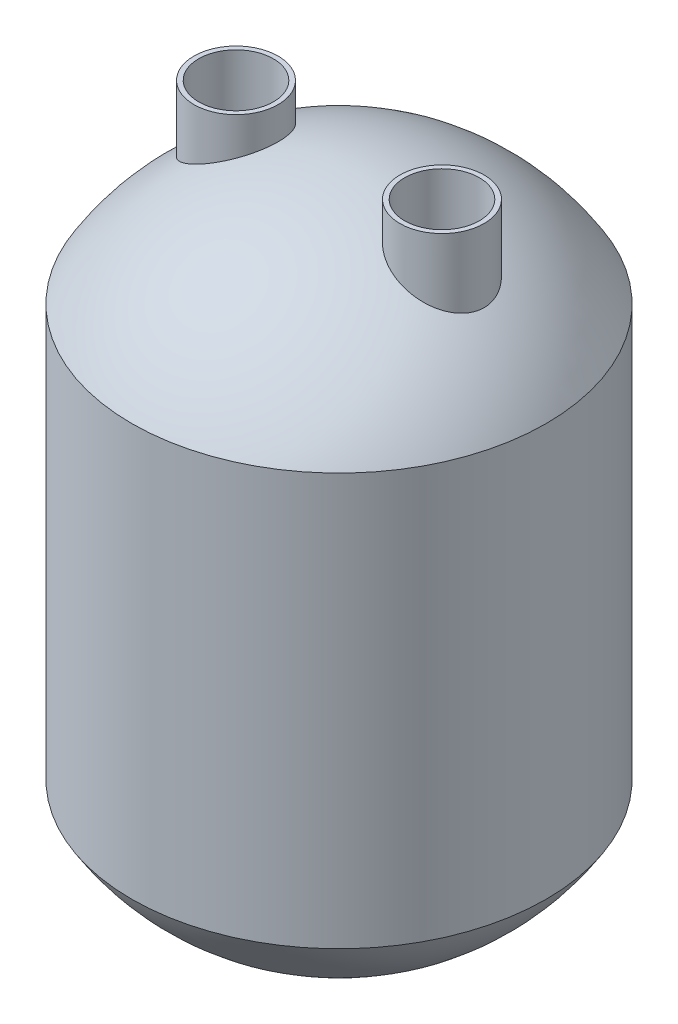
ISO-10303-21;
HEADER;
FILE_DESCRIPTION(('STEP AP214'),'2;1');
FILE_NAME('part.step','',(''),(''),'','','');
FILE_SCHEMA(('AUTOMOTIVE_DESIGN { 1 0 10303 214 1 1 1 1 }'));
ENDSEC;
DATA;
#1=APPLICATION_CONTEXT('core data for automotive mechanical design processes');
#2=APPLICATION_PROTOCOL_DEFINITION('international standard','automotive_design',2000,#1);
#3=PRODUCT_CONTEXT('',#1,'mechanical');
#4=PRODUCT('Part','Part','',(#3));
#5=PRODUCT_RELATED_PRODUCT_CATEGORY('part','',(#4));
#6=PRODUCT_DEFINITION_FORMATION('','',#4);
#7=PRODUCT_DEFINITION_CONTEXT('part definition',#1,'design');
#8=PRODUCT_DEFINITION('design','',#6,#7);
#9=PRODUCT_DEFINITION_SHAPE('','',#8);
#10=(LENGTH_UNIT() NAMED_UNIT(*) SI_UNIT(.MILLI.,.METRE.));
#11=(NAMED_UNIT(*) PLANE_ANGLE_UNIT() SI_UNIT($,.RADIAN.));
#12=(NAMED_UNIT(*) SI_UNIT($,.STERADIAN.) SOLID_ANGLE_UNIT());
#13=UNCERTAINTY_MEASURE_WITH_UNIT(LENGTH_MEASURE(1.E-05),#10,'distance_accuracy_value','');
#14=(GEOMETRIC_REPRESENTATION_CONTEXT(3) GLOBAL_UNCERTAINTY_ASSIGNED_CONTEXT((#13)) GLOBAL_UNIT_ASSIGNED_CONTEXT((#10,
#11,#12)) REPRESENTATION_CONTEXT('',''));
#15=CARTESIAN_POINT('',(0.,0.,0.));
#16=DIRECTION('',(0.,0.,1.));
#17=DIRECTION('',(1.,0.,0.));
#18=AXIS2_PLACEMENT_3D('',#15,#16,#17);
#19=CARTESIAN_POINT('',(0.,79.6999306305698,0.));
#20=DIRECTION('',(0.,1.,0.));
#21=DIRECTION('',(1.,0.,0.));
#22=AXIS2_PLACEMENT_3D('',#19,#20,#21);
#23=SPHERICAL_SURFACE('',#22,78.);
#24=CARTESIAN_POINT('',(32.7212474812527,149.083089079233,-14.1172691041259));
#25=CARTESIAN_POINT('',(33.1679584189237,148.857747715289,-14.1893744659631));
#26=CARTESIAN_POINT('',(33.6169962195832,148.630132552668,-14.2400963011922));
#27=CARTESIAN_POINT('',(34.5165230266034,148.171865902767,-14.2989339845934));
#28=CARTESIAN_POINT('',(34.9670125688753,147.941213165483,-14.3070317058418));
#29=CARTESIAN_POINT('',(35.8667764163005,147.478167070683,-14.2808118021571));
#30=CARTESIAN_POINT('',(36.3160475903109,147.245771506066,-14.2464257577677));
#31=CARTESIAN_POINT('',(37.2096489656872,146.78113934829,-14.1354252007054));
#32=CARTESIAN_POINT('',(37.6539771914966,146.548902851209,-14.0587943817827));
#33=CARTESIAN_POINT('',(38.5342018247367,146.086445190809,-13.8637133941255));
#34=CARTESIAN_POINT('',(38.9701015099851,145.856223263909,-13.7452798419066));
#35=CARTESIAN_POINT('',(39.8304714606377,145.399467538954,-13.4670319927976));
#36=CARTESIAN_POINT('',(40.2549421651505,145.172933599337,-13.3072192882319));
#37=CARTESIAN_POINT('',(41.0892307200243,144.725417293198,-12.9467278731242));
#38=CARTESIAN_POINT('',(41.4990485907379,144.504434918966,-12.7460492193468));
#39=CARTESIAN_POINT('',(42.3004416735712,144.070158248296,-12.3045808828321));
#40=CARTESIAN_POINT('',(42.6920269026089,143.856859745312,-12.0638135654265));
#41=CARTESIAN_POINT('',(43.4451333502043,143.444673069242,-11.5487289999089));
#42=CARTESIAN_POINT('',(43.8071310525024,143.245569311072,-11.2752824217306));
#43=CARTESIAN_POINT('',(44.506841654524,142.859003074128,-10.6919295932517));
#44=CARTESIAN_POINT('',(44.8445668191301,142.671534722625,-10.3820419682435));
#45=CARTESIAN_POINT('',(45.4922393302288,142.310519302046,-9.72701856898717));
#46=CARTESIAN_POINT('',(45.8021910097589,142.136970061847,-9.38188831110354));
#47=CARTESIAN_POINT('',(46.2432100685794,141.88909483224,-8.83937705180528));
#48=CARTESIAN_POINT('',(46.3862287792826,141.808546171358,-8.65440835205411));
#49=CARTESIAN_POINT('',(46.6639128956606,141.651865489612,-8.27636152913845));
#50=CARTESIAN_POINT('',(46.7985747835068,141.575735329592,-8.08328004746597));
#51=CARTESIAN_POINT('',(47.1612213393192,141.370359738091,-7.53473751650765));
#52=CARTESIAN_POINT('',(47.3794802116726,141.246333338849,-7.17079271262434));
#53=CARTESIAN_POINT('',(47.7846192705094,141.015507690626,-6.42067877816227));
#54=CARTESIAN_POINT('',(47.9715060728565,140.908704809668,-6.03451435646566));
#55=CARTESIAN_POINT('',(48.2261603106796,140.762858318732,-5.44105070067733));
#56=CARTESIAN_POINT('',(48.3067476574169,140.716646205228,-5.24091524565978));
#57=CARTESIAN_POINT('',(48.4590807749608,140.629203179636,-4.83630799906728));
#58=CARTESIAN_POINT('',(48.5308288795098,140.587970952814,-4.63183736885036));
#59=CARTESIAN_POINT('',(48.7323698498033,140.472046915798,-4.01251868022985));
#60=CARTESIAN_POINT('',(48.8485177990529,140.405094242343,-3.59162807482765));
#61=CARTESIAN_POINT('',(49.0288079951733,140.301050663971,-2.79729323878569));
#62=CARTESIAN_POINT('',(49.0979186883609,140.26111183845,-2.42532921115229));
#63=CARTESIAN_POINT('',(49.2065294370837,140.19831022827,-1.6756726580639));
#64=CARTESIAN_POINT('',(49.246032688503,140.175445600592,-1.29798075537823));
#65=CARTESIAN_POINT('',(49.2948362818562,140.147194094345,-0.540170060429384));
#66=CARTESIAN_POINT('',(49.3041496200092,140.141799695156,-0.160052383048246));
#67=CARTESIAN_POINT('',(49.2924731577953,140.148560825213,0.599558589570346));
#68=CARTESIAN_POINT('',(49.2714843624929,140.160715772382,0.979051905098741));
#69=CARTESIAN_POINT('',(49.2023408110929,140.200728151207,1.70463114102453));
#70=CARTESIAN_POINT('',(49.1564407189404,140.22728219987,2.05100717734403));
#71=CARTESIAN_POINT('',(49.039738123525,140.294727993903,2.73809489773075));
#72=CARTESIAN_POINT('',(48.9689373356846,140.335618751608,3.07880697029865));
#73=CARTESIAN_POINT('',(48.803268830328,140.431170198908,3.75233968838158));
#74=CARTESIAN_POINT('',(48.7084012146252,140.485830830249,4.08516036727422));
#75=CARTESIAN_POINT('',(48.4956561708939,140.608204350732,4.740895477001));
#76=CARTESIAN_POINT('',(48.3777778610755,140.675917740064,5.0638095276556));
#77=CARTESIAN_POINT('',(48.1170897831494,140.825370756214,5.70568714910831));
#78=CARTESIAN_POINT('',(47.9737407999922,140.90741290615,6.02436097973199));
#79=CARTESIAN_POINT('',(47.6656313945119,141.083344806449,6.64775776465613));
#80=CARTESIAN_POINT('',(47.5008708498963,141.177234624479,6.95248063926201));
#81=CARTESIAN_POINT('',(47.1514199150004,141.375861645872,7.54664209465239));
#82=CARTESIAN_POINT('',(46.9667255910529,141.48060099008,7.83607764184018));
#83=CARTESIAN_POINT('',(46.578962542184,141.699887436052,8.39847102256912));
#84=CARTESIAN_POINT('',(46.3758918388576,141.814435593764,8.67142707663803));
#85=CARTESIAN_POINT('',(45.9315498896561,142.064332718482,9.22659543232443));
#86=CARTESIAN_POINT('',(45.6884918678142,142.200614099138,9.50695892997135));
#87=CARTESIAN_POINT('',(45.183970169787,142.482507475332,10.0455429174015));
#88=CARTESIAN_POINT('',(44.9225054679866,142.628119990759,10.3037621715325));
#89=CARTESIAN_POINT('',(44.3830478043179,142.9274487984,10.7973186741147));
#90=CARTESIAN_POINT('',(44.1050516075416,143.081166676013,11.0326514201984));
#91=CARTESIAN_POINT('',(43.5343309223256,143.395547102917,11.4798380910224));
#92=CARTESIAN_POINT('',(43.2416012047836,143.556212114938,11.6916835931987));
#93=CARTESIAN_POINT('',(42.6051756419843,143.904149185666,12.1167551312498));
#94=CARTESIAN_POINT('',(42.2597332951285,144.092206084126,12.3267289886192));
#95=CARTESIAN_POINT('',(41.5548649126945,144.474199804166,12.7155727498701));
#96=CARTESIAN_POINT('',(41.1954375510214,144.668137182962,12.894439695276));
#97=CARTESIAN_POINT('',(40.4647273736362,145.060603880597,13.2207006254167));
#98=CARTESIAN_POINT('',(40.09343855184,145.259135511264,13.3680783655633));
#99=CARTESIAN_POINT('',(39.3415149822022,145.65934232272,13.6308410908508));
#100=CARTESIAN_POINT('',(38.9608826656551,145.861016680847,13.7462343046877));
#101=CARTESIAN_POINT('',(38.1533679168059,146.286896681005,13.9548316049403));
#102=CARTESIAN_POINT('',(37.7257070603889,146.511314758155,14.0446026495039));
#103=CARTESIAN_POINT('',(36.8644073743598,146.961004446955,14.1846525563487));
#104=CARTESIAN_POINT('',(36.4307683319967,147.186276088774,14.2349300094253));
#105=CARTESIAN_POINT('',(35.5602626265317,147.636240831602,14.2956815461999));
#106=CARTESIAN_POINT('',(35.1233951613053,147.860933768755,14.30614538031));
#107=CARTESIAN_POINT('',(34.2494160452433,148.308245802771,14.2869767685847));
#108=CARTESIAN_POINT('',(33.8123043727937,148.530864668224,14.2573399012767));
#109=CARTESIAN_POINT('',(32.9258150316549,148.980195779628,14.1560436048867));
#110=CARTESIAN_POINT('',(32.4765348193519,149.206784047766,14.0829688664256));
#111=CARTESIAN_POINT('',(31.5846084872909,149.654469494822,13.89362816));
#112=CARTESIAN_POINT('',(31.1419599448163,149.875568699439,13.7773783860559));
#113=CARTESIAN_POINT('',(30.2665760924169,150.310815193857,13.501674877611));
#114=CARTESIAN_POINT('',(29.8338426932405,150.524961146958,13.3422128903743));
#115=CARTESIAN_POINT('',(29.195340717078,150.839562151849,13.0709388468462));
#116=CARTESIAN_POINT('',(28.9842717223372,150.943326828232,12.9751665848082));
#117=CARTESIAN_POINT('',(28.5660275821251,151.148503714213,12.7729392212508));
#118=CARTESIAN_POINT('',(28.358853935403,151.249915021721,12.6664801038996));
#119=CARTESIAN_POINT('',(27.7619231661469,151.541506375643,12.340968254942));
#120=CARTESIAN_POINT('',(27.3780539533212,151.728251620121,12.1078138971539));
#121=CARTESIAN_POINT('',(26.6305231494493,152.090580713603,11.6036684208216));
#122=CARTESIAN_POINT('',(26.2668594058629,152.266165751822,11.3326813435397));
#123=CARTESIAN_POINT('',(25.5636436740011,152.604550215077,10.7541785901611));
#124=CARTESIAN_POINT('',(25.2240814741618,152.767355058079,10.4466785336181));
#125=CARTESIAN_POINT('',(24.572901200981,153.078613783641,9.79679179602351));
#126=CARTESIAN_POINT('',(24.2612799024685,153.22706932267,9.45440915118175));
#127=CARTESIAN_POINT('',(23.6985467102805,153.494428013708,8.77174672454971));
#128=CARTESIAN_POINT('',(23.4444975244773,153.614800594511,8.43445803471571));
#129=CARTESIAN_POINT('',(22.9653331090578,153.841346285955,7.73538764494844));
#130=CARTESIAN_POINT('',(22.7402132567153,153.947521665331,7.37360987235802));
#131=CARTESIAN_POINT('',(22.4264160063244,154.095248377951,6.81473944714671));
#132=CARTESIAN_POINT('',(22.3258036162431,154.142564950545,6.62576261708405));
#133=CARTESIAN_POINT('',(22.1328425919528,154.233232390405,6.24277445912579));
#134=CARTESIAN_POINT('',(22.0404918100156,154.276584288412,6.04876445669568));
#135=CARTESIAN_POINT('',(21.7762713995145,154.400518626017,5.45967802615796));
#136=CARTESIAN_POINT('',(21.6171807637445,154.475004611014,5.05745108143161));
#137=CARTESIAN_POINT('',(21.3498722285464,154.600013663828,4.27966348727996));
#138=CARTESIAN_POINT('',(21.2381183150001,154.652207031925,3.90557419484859));
#139=CARTESIAN_POINT('',(21.0452977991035,154.742193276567,3.14786310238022));
#140=CARTESIAN_POINT('',(20.9642288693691,154.779987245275,2.76424202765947));
#141=CARTESIAN_POINT('',(20.8338010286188,154.840764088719,1.99063782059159));
#142=CARTESIAN_POINT('',(20.7844305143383,154.86375238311,1.60065706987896));
#143=CARTESIAN_POINT('',(20.7179698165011,154.894693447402,0.817361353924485));
#144=CARTESIAN_POINT('',(20.7008785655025,154.902646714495,0.424046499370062));
#145=CARTESIAN_POINT('',(20.6992404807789,154.903409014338,-0.337928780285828));
#146=CARTESIAN_POINT('',(20.7127166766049,154.897138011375,-0.706585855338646));
#147=CARTESIAN_POINT('',(20.7680502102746,154.87137901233,-1.44128347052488));
#148=CARTESIAN_POINT('',(20.8099060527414,154.851891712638,-1.80732414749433));
#149=CARTESIAN_POINT('',(20.9215310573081,154.799887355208,-2.53414474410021));
#150=CARTESIAN_POINT('',(20.9912977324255,154.767371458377,-2.89492512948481));
#151=CARTESIAN_POINT('',(21.1579903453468,154.689611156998,-3.60875424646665));
#152=CARTESIAN_POINT('',(21.254916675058,154.644366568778,-3.96180286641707));
#153=CARTESIAN_POINT('',(21.4745013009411,154.541747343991,-4.65651239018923));
#154=CARTESIAN_POINT('',(21.5970627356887,154.484418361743,-4.99821070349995));
#155=CARTESIAN_POINT('',(21.8669019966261,154.358023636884,-5.66944284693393));
#156=CARTESIAN_POINT('',(22.0141795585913,154.288958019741,-5.99897680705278));
#157=CARTESIAN_POINT('',(22.332051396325,154.139651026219,-6.64397117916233));
#158=CARTESIAN_POINT('',(22.5026467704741,154.05940912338,-6.95943092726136));
#159=CARTESIAN_POINT('',(22.8656055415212,153.888372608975,-7.57456390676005));
#160=CARTESIAN_POINT('',(23.0579696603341,153.797577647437,-7.87423661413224));
#161=CARTESIAN_POINT('',(23.4730354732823,153.601267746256,-8.47099506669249));
#162=CARTESIAN_POINT('',(23.6967776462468,153.495241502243,-8.76718891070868));
#163=CARTESIAN_POINT('',(24.1644994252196,153.273073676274,-9.33907926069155));
#164=CARTESIAN_POINT('',(24.4084796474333,153.156931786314,-9.61477514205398));
#165=CARTESIAN_POINT('',(24.9147512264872,152.915311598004,-10.1445572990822));
#166=CARTESIAN_POINT('',(25.1770480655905,152.789830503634,-10.3986370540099));
#167=CARTESIAN_POINT('',(25.7180011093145,152.530327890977,-10.8842399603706));
#168=CARTESIAN_POINT('',(25.9966644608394,152.396302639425,-11.1157531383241));
#169=CARTESIAN_POINT('',(26.5932730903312,152.108516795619,-11.5745689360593));
#170=CARTESIAN_POINT('',(26.9125232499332,151.954055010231,-11.7997364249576));
#171=CARTESIAN_POINT('',(27.5653469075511,151.637131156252,-12.221576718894));
#172=CARTESIAN_POINT('',(27.8989159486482,151.474671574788,-12.418258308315));
#173=CARTESIAN_POINT('',(28.5778826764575,151.142814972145,-12.7825953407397));
#174=CARTESIAN_POINT('',(28.9232724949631,150.973422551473,-12.9502696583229));
#175=CARTESIAN_POINT('',(29.6237168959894,150.628623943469,-13.2563811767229));
#176=CARTESIAN_POINT('',(29.9787690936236,150.453219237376,-13.3948255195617));
#177=CARTESIAN_POINT('',(30.7277086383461,150.081801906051,-13.6531232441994));
#178=CARTESIAN_POINT('',(31.1222866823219,149.885324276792,-13.7703102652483));
#179=CARTESIAN_POINT('',(31.917695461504,149.487543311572,-13.9698799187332));
#180=CARTESIAN_POINT('',(32.3185258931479,149.28624020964,-14.0522642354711));
#181=CARTESIAN_POINT('',(32.7212474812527,149.083089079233,-14.1172691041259));
#182=B_SPLINE_CURVE_WITH_KNOTS('',3,(#24,#25,#26,#27,#28,#29,#30,#31,#32,#33,#34,#35,#36,#37,
#38,#39,#40,#41,#42,#43,#44,#45,#46,#47,#48,#49,#50,#51,#52,#53,#54,#55,#56,#57,#58,#59,#60,#61,
#62,#63,#64,#65,#66,#67,#68,#69,#70,#71,#72,#73,#74,#75,#76,#77,#78,#79,#80,#81,#82,#83,#84,#85,
#86,#87,#88,#89,#90,#91,#92,#93,#94,#95,#96,#97,#98,#99,#100,#101,#102,#103,#104,#105,#106,#107,
#108,#109,#110,#111,#112,#113,#114,#115,#116,#117,#118,#119,#120,#121,#122,#123,#124,#125,#126,
#127,#128,#129,#130,#131,#132,#133,#134,#135,#136,#137,#138,#139,#140,#141,#142,#143,#144,#145,
#146,#147,#148,#149,#150,#151,#152,#153,#154,#155,#156,#157,#158,#159,#160,#161,#162,#163,#164,
#165,#166,#167,#168,#169,#170,#171,#172,#173,#174,#175,#176,#177,#178,#179,#180,#181),
.UNSPECIFIED.,.T.,.F.,(4,2,2,2,2,2,2,2,2,2,2,2,2,2,2,2,2,2,2,2,2,2,2,2,2,2,2,2,2,2,2,2,2,2,2,2,
2,2,2,2,2,2,2,2,2,2,2,2,2,2,2,2,2,2,2,2,2,2,2,2,2,2,2,2,2,2,2,2,2,2,2,2,2,2,2,2,2,2,4),(0.,
1.51608137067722,3.0328074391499,4.55197935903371,6.07173808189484,7.59089338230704,
9.10999023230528,10.6290849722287,12.1473350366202,13.6316330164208,15.1151756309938,
16.5984863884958,17.3401089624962,18.0820416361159,19.406405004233,20.7304887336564,
21.3921777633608,22.0536917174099,23.3762670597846,24.5160893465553,25.6557885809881,
26.79499713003,27.9341678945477,28.9841831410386,30.0341260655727,31.0840645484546,
32.1340432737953,33.2096999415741,34.2853627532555,35.361238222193,36.437229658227,
37.6218788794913,38.8065941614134,39.9915420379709,41.176913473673,42.5130676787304,
43.8493488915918,45.1863178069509,46.5229424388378,47.9950009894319,49.467112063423,
50.9396020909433,52.4122544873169,53.9357430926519,55.4586608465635,56.9818696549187,
57.7434841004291,58.5053858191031,59.9624873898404,61.4194334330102,62.875758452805,
64.331915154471,65.6474238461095,66.9627220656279,67.6202781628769,68.2776628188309,
69.5921010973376,70.7723113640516,71.952432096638,73.1321205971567,74.311770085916,
75.417314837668,76.5228013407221,77.6281893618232,78.7335933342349,79.8348936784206,
80.9361822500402,82.0375227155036,83.1388997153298,84.2957962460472,85.4527280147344,
86.6100075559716,87.76779626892,89.026740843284,90.2852963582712,91.5430298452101,
92.8004556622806,94.1673088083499,95.5340957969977),.UNSPECIFIED.);
#183=CARTESIAN_POINT('',(32.7212474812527,149.083089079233,-14.1172691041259));
#184=VERTEX_POINT('',#183);
#185=EDGE_CURVE('E49',#184,#184,#182,.T.);
#186=ORIENTED_EDGE('',*,*,#185,.F.);
#187=EDGE_LOOP('',(#186));
#188=FACE_BOUND('',#187,.T.);
#189=CARTESIAN_POINT('',(0.,120.58291168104,0.));
#190=DIRECTION('',(0.,1.,0.));
#191=DIRECTION('',(-1.,0.,0.));
#192=AXIS2_PLACEMENT_3D('',#189,#190,#191);
#193=CIRCLE('',#192,66.4272674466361);
#194=CARTESIAN_POINT('',(-66.4272674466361,120.58291168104,0.));
#195=VERTEX_POINT('',#194);
#196=EDGE_CURVE('E102',#195,#195,#193,.T.);
#197=ORIENTED_EDGE('',*,*,#196,.F.);
#198=EDGE_LOOP('',(#197));
#199=FACE_BOUND('',#198,.T.);
#200=CARTESIAN_POINT('',(-44.6565693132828,142.775679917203,-10.5470692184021));
#201=CARTESIAN_POINT('',(-44.3290617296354,142.957409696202,-10.8469220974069));
#202=CARTESIAN_POINT('',(-43.9893337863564,143.145133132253,-11.1299130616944));
#203=CARTESIAN_POINT('',(-43.2886798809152,143.530484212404,-11.6610992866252));
#204=CARTESIAN_POINT('',(-42.9277415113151,143.728117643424,-11.9092738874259));
#205=CARTESIAN_POINT('',(-42.1870160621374,144.131752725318,-12.3704317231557));
#206=CARTESIAN_POINT('',(-41.8071851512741,144.33777361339,-12.5833276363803));
#207=CARTESIAN_POINT('',(-41.032533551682,144.755878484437,-12.972525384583));
#208=CARTESIAN_POINT('',(-40.6377151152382,144.96796155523,-13.1488326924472));
#209=CARTESIAN_POINT('',(-39.8374689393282,145.395689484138,-13.4637681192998));
#210=CARTESIAN_POINT('',(-39.4320895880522,145.611316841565,-13.6025431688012));
#211=CARTESIAN_POINT('',(-38.611801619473,146.045473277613,-13.842963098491));
#212=CARTESIAN_POINT('',(-38.1968897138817,146.264003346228,-13.9445949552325));
#213=CARTESIAN_POINT('',(-37.3606216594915,146.702277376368,-14.1102454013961));
#214=CARTESIAN_POINT('',(-36.9392700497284,146.922020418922,-14.1742893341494));
#215=CARTESIAN_POINT('',(-36.0925531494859,147.361437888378,-14.2645581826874));
#216=CARTESIAN_POINT('',(-35.667188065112,147.581112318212,-14.2907850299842));
#217=CARTESIAN_POINT('',(-34.7908994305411,148.031479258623,-14.3055561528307));
#218=CARTESIAN_POINT('',(-34.3398914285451,148.262091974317,-14.2918845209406));
#219=CARTESIAN_POINT('',(-33.6648082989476,148.605565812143,-14.2393203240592));
#220=CARTESIAN_POINT('',(-33.4400052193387,148.719656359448,-14.216453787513));
#221=CARTESIAN_POINT('',(-32.9911797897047,148.94688237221,-14.1600075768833));
#222=CARTESIAN_POINT('',(-32.7671576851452,149.060017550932,-14.1264247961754));
#223=CARTESIAN_POINT('',(-32.0969343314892,149.397672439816,-14.0095630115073));
#224=CARTESIAN_POINT('',(-31.6525520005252,149.620453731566,-13.9101687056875));
#225=CARTESIAN_POINT('',(-30.7724724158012,150.059614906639,-13.6684415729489));
#226=CARTESIAN_POINT('',(-30.3367745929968,150.275995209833,-13.5261115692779));
#227=CARTESIAN_POINT('',(-29.4850304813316,150.697123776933,-13.2014848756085));
#228=CARTESIAN_POINT('',(-29.0687754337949,150.902007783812,-13.0199143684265));
#229=CARTESIAN_POINT('',(-28.2520784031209,151.302336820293,-12.6159833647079));
#230=CARTESIAN_POINT('',(-27.8516292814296,151.497786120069,-12.3936415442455));
#231=CARTESIAN_POINT('',(-27.0702146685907,151.877704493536,-11.9088112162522));
#232=CARTESIAN_POINT('',(-26.6892469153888,152.062174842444,-11.6463273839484));
#233=CARTESIAN_POINT('',(-26.1356568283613,152.329277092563,-11.2235192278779));
#234=CARTESIAN_POINT('',(-25.9541042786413,152.416710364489,-11.0777366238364));
#235=CARTESIAN_POINT('',(-25.5973451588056,152.588223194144,-10.7765760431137));
#236=CARTESIAN_POINT('',(-25.4221410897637,152.672301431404,-10.6211943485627));
#237=CARTESIAN_POINT('',(-24.9354665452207,152.905463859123,-10.1676169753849));
#238=CARTESIAN_POINT('',(-24.632163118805,153.050306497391,-9.85835305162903));
#239=CARTESIAN_POINT('',(-24.0523065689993,153.326472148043,-9.21015941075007));
#240=CARTESIAN_POINT('',(-23.7757492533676,153.457797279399,-8.87123435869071));
#241=CARTESIAN_POINT('',(-23.383529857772,153.643603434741,-8.34241070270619));
#242=CARTESIAN_POINT('',(-23.2565677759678,153.703671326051,-8.16274374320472));
#243=CARTESIAN_POINT('',(-23.0105670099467,153.819925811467,-7.79692757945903));
#244=CARTESIAN_POINT('',(-22.8915262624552,153.87611341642,-7.61078008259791));
#245=CARTESIAN_POINT('',(-22.5468354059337,154.038637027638,-7.04305034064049));
#246=CARTESIAN_POINT('',(-22.3335456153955,154.138967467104,-6.65208524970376));
#247=CARTESIAN_POINT('',(-21.9638452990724,154.312580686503,-5.89136331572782));
#248=CARTESIAN_POINT('',(-21.8038013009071,154.387603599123,-5.52375549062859));
#249=CARTESIAN_POINT('',(-21.5144486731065,154.523076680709,-4.77402172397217));
#250=CARTESIAN_POINT('',(-21.3851377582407,154.58352793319,-4.39189686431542));
#251=CARTESIAN_POINT('',(-21.158923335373,154.689184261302,-3.61631259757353));
#252=CARTESIAN_POINT('',(-21.0620047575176,154.734396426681,-3.22285855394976));
#253=CARTESIAN_POINT('',(-20.9017483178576,154.809111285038,-2.4277041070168));
#254=CARTESIAN_POINT('',(-20.8384085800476,154.838614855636,-2.02600416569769));
#255=CARTESIAN_POINT('',(-20.749851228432,154.879853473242,-1.25028617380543));
#256=CARTESIAN_POINT('',(-20.7219821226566,154.892824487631,-0.876633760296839));
#257=CARTESIAN_POINT('',(-20.6956711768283,154.905070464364,-0.128083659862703));
#258=CARTESIAN_POINT('',(-20.6972274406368,154.904346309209,0.246813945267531));
#259=CARTESIAN_POINT('',(-20.7297442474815,154.889211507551,0.994980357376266));
#260=CARTESIAN_POINT('',(-20.7606993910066,154.874803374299,1.36824945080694));
#261=CARTESIAN_POINT('',(-20.8516515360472,154.832445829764,2.11045434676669));
#262=CARTESIAN_POINT('',(-20.9116485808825,154.804496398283,2.47939014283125));
#263=CARTESIAN_POINT('',(-21.0581670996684,154.736184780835,3.20117775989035));
#264=CARTESIAN_POINT('',(-21.1439946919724,154.696147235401,3.5542016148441));
#265=CARTESIAN_POINT('',(-21.3417261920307,154.603811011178,4.25120963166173));
#266=CARTESIAN_POINT('',(-21.4536294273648,154.551512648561,4.59519402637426));
#267=CARTESIAN_POINT('',(-21.7023908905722,154.435103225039,5.27196133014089));
#268=CARTESIAN_POINT('',(-21.8392501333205,154.37099168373,5.60474378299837));
#269=CARTESIAN_POINT('',(-22.1366025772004,154.231485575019,6.25711770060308));
#270=CARTESIAN_POINT('',(-22.2970964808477,154.156090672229,6.57670877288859));
#271=CARTESIAN_POINT('',(-22.6459483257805,153.991925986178,7.21129819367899));
#272=CARTESIAN_POINT('',(-22.8350545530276,153.902795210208,7.52579164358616));
#273=CARTESIAN_POINT('',(-23.2351806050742,153.713823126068,8.13710574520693));
#274=CARTESIAN_POINT('',(-23.4462007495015,153.613981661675,8.433926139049));
#275=CARTESIAN_POINT('',(-23.8883644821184,153.404309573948,9.00849533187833));
#276=CARTESIAN_POINT('',(-24.1195112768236,153.294477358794,9.2862410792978));
#277=CARTESIAN_POINT('',(-24.6000487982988,153.065588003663,9.82142430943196));
#278=CARTESIAN_POINT('',(-24.8494412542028,152.946529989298,10.0788598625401));
#279=CARTESIAN_POINT('',(-25.3843540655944,152.690497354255,10.5913578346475));
#280=CARTESIAN_POINT('',(-25.6711782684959,152.552848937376,10.8447234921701));
#281=CARTESIAN_POINT('',(-26.2614778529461,152.26870308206,11.3257768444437));
#282=CARTESIAN_POINT('',(-26.5649539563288,152.122205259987,11.5534634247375));
#283=CARTESIAN_POINT('',(-27.1863723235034,151.821262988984,11.9824793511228));
#284=CARTESIAN_POINT('',(-27.504318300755,151.666816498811,12.1838018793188));
#285=CARTESIAN_POINT('',(-28.1524257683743,151.350926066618,12.5595004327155));
#286=CARTESIAN_POINT('',(-28.4825881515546,151.189481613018,12.7338744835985));
#287=CARTESIAN_POINT('',(-29.1856608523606,150.84447583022,13.070954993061));
#288=CARTESIAN_POINT('',(-29.5596038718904,150.660291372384,13.2308733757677));
#289=CARTESIAN_POINT('',(-30.3169872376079,150.285736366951,13.517520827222));
#290=CARTESIAN_POINT('',(-30.7004281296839,150.095365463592,13.6442479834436));
#291=CARTESIAN_POINT('',(-31.4743175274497,149.709537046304,13.8643941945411));
#292=CARTESIAN_POINT('',(-31.8647671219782,149.514078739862,13.9578080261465));
#293=CARTESIAN_POINT('',(-32.650314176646,149.119142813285,14.1113149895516));
#294=CARTESIAN_POINT('',(-33.0454132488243,148.919663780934,14.1713961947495));
#295=CARTESIAN_POINT('',(-33.8727613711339,148.500108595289,14.2620978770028));
#296=CARTESIAN_POINT('',(-34.3052142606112,148.279767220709,14.289653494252));
#297=CARTESIAN_POINT('',(-35.1699557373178,147.837013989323,14.3055306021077));
#298=CARTESIAN_POINT('',(-35.6022442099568,147.614601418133,14.2938380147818));
#299=CARTESIAN_POINT('',(-36.4637636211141,147.169154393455,14.2314422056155));
#300=CARTESIAN_POINT('',(-36.8929940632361,146.946119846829,14.1807327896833));
#301=CARTESIAN_POINT('',(-37.7455580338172,146.500907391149,14.0406037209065));
#302=CARTESIAN_POINT('',(-38.1688913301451,146.278729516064,13.9511825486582));
#303=CARTESIAN_POINT('',(-39.0256191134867,145.826853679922,13.7291243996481));
#304=CARTESIAN_POINT('',(-39.4586176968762,145.59726340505,13.594734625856));
#305=CARTESIAN_POINT('',(-40.3117684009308,145.142561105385,13.2846172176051));
#306=CARTESIAN_POINT('',(-40.7319251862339,144.91744746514,13.1089047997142));
#307=CARTESIAN_POINT('',(-41.5563976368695,144.473470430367,12.716608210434));
#308=CARTESIAN_POINT('',(-41.960708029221,144.254609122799,12.5000105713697));
#309=CARTESIAN_POINT('',(-42.7499212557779,143.82528905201,12.0266562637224));
#310=CARTESIAN_POINT('',(-43.1348224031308,143.614831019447,11.769896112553));
#311=CARTESIAN_POINT('',(-43.8694940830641,143.211227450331,11.2260480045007));
#312=CARTESIAN_POINT('',(-44.2199966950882,143.017742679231,10.9402026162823));
#313=CARTESIAN_POINT('',(-44.8956688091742,142.643145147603,10.333051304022));
#314=CARTESIAN_POINT('',(-45.2208513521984,142.462026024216,10.011763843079));
#315=CARTESIAN_POINT('',(-45.8423290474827,142.114489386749,9.33513336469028));
#316=CARTESIAN_POINT('',(-46.13863423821,141.948066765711,8.97980226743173));
#317=CARTESIAN_POINT('',(-46.5584308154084,141.711430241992,8.42298973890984));
#318=CARTESIAN_POINT('',(-46.6942498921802,141.634719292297,8.23342100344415));
#319=CARTESIAN_POINT('',(-46.9572869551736,141.48589544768,7.84652939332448));
#320=CARTESIAN_POINT('',(-47.0845013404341,141.413784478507,7.64920332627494));
#321=CARTESIAN_POINT('',(-47.4245178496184,141.22073182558,7.09192951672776));
#322=CARTESIAN_POINT('',(-47.6275412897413,141.105089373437,6.72408547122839));
#323=CARTESIAN_POINT('',(-48.0020248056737,140.891267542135,5.96785456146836));
#324=CARTESIAN_POINT('',(-48.1734914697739,140.793084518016,5.57947200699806));
#325=CARTESIAN_POINT('',(-48.4050357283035,140.660241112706,4.98401302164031));
#326=CARTESIAN_POINT('',(-48.4779263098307,140.618373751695,4.78343044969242));
#327=CARTESIAN_POINT('',(-48.6148986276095,140.539626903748,4.37838361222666));
#328=CARTESIAN_POINT('',(-48.678982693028,140.502746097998,4.17392038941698));
#329=CARTESIAN_POINT('',(-48.8576247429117,140.399856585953,3.55531554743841));
#330=CARTESIAN_POINT('',(-48.9586238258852,140.341571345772,3.13582735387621));
#331=CARTESIAN_POINT('',(-49.1113539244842,140.253352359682,2.34502775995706));
#332=CARTESIAN_POINT('',(-49.1679232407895,140.220637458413,1.97494113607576));
#333=CARTESIAN_POINT('',(-49.2518929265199,140.172057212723,1.23037461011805));
#334=CARTESIAN_POINT('',(-49.2792964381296,140.156190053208,0.855895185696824));
#335=CARTESIAN_POINT('',(-49.3045309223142,140.14157925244,0.105777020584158));
#336=CARTESIAN_POINT('',(-49.3023745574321,140.142828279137,-0.269861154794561));
#337=CARTESIAN_POINT('',(-49.2685532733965,140.162409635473,-1.01935678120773));
#338=CARTESIAN_POINT('',(-49.2368890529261,140.180741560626,-1.39321427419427));
#339=CARTESIAN_POINT('',(-49.1477044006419,140.232329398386,-2.11042913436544));
#340=CARTESIAN_POINT('',(-49.0921198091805,140.264467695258,-2.45411037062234));
#341=CARTESIAN_POINT('',(-48.9564532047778,140.342818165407,-3.13494606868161));
#342=CARTESIAN_POINT('',(-48.8763725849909,140.38902953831,-3.4721009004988));
#343=CARTESIAN_POINT('',(-48.6926052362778,140.494917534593,-4.13785717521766));
#344=CARTESIAN_POINT('',(-48.588910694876,140.554598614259,-4.46645574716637));
#345=CARTESIAN_POINT('',(-48.359055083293,140.686654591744,-5.11306096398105));
#346=CARTESIAN_POINT('',(-48.2328935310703,140.759029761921,-5.43106738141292));
#347=CARTESIAN_POINT('',(-47.9547021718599,140.918288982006,-6.06545237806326));
#348=CARTESIAN_POINT('',(-47.8019361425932,141.005584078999,-6.38140456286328));
#349=CARTESIAN_POINT('',(-47.4752373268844,141.191816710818,-6.99859922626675));
#350=CARTESIAN_POINT('',(-47.301302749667,141.290755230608,-7.29984045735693));
#351=CARTESIAN_POINT('',(-46.9340204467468,141.499116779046,-7.88597890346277));
#352=CARTESIAN_POINT('',(-46.7406914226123,141.608529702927,-8.17089145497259));
#353=CARTESIAN_POINT('',(-46.3361058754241,141.836840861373,-8.7235285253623));
#354=CARTESIAN_POINT('',(-46.1248541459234,141.955736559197,-8.99125760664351));
#355=CARTESIAN_POINT('',(-45.709590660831,142.188735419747,-9.48083903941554));
#356=CARTESIAN_POINT('',(-45.5072511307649,142.301974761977,-9.70452635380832));
#357=CARTESIAN_POINT('',(-45.0906303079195,142.534470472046,-10.1370280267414));
#358=CARTESIAN_POINT('',(-44.8763514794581,142.653725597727,-10.3458454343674));
#359=CARTESIAN_POINT('',(-44.6565693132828,142.775679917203,-10.5470692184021));
#360=B_SPLINE_CURVE_WITH_KNOTS('',3,(#200,#201,#202,#203,#204,#205,#206,#207,#208,#209,#210,
#211,#212,#213,#214,#215,#216,#217,#218,#219,#220,#221,#222,#223,#224,#225,#226,#227,#228,#229,
#230,#231,#232,#233,#234,#235,#236,#237,#238,#239,#240,#241,#242,#243,#244,#245,#246,#247,#248,
#249,#250,#251,#252,#253,#254,#255,#256,#257,#258,#259,#260,#261,#262,#263,#264,#265,#266,#267,
#268,#269,#270,#271,#272,#273,#274,#275,#276,#277,#278,#279,#280,#281,#282,#283,#284,#285,#286,
#287,#288,#289,#290,#291,#292,#293,#294,#295,#296,#297,#298,#299,#300,#301,#302,#303,#304,#305,
#306,#307,#308,#309,#310,#311,#312,#313,#314,#315,#316,#317,#318,#319,#320,#321,#322,#323,#324,
#325,#326,#327,#328,#329,#330,#331,#332,#333,#334,#335,#336,#337,#338,#339,#340,#341,#342,#343,
#344,#345,#346,#347,#348,#349,#350,#351,#352,#353,#354,#355,#356,#357,#358,#359),.UNSPECIFIED.,
.T.,.F.,(4,2,2,2,2,2,2,2,2,2,2,2,2,2,2,2,2,2,2,2,2,2,2,2,2,2,2,2,2,2,2,2,2,2,2,2,2,2,2,2,2,2,2,
2,2,2,2,2,2,2,2,2,2,2,2,2,2,2,2,2,2,2,2,2,2,2,2,2,2,2,2,2,2,2,2,2,2,2,2,4),(0.,1.43904820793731,
2.87894675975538,4.3223577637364,5.76555270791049,7.20301327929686,8.64097738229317,
10.0779708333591,11.5148908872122,13.0331071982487,13.7923069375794,14.5517269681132,
16.0704861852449,17.5891455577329,19.081797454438,20.5737673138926,22.0655635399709,
22.8114568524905,23.5576408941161,24.9258983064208,26.2939409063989,26.9778642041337,
27.6616086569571,29.0287277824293,30.2508390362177,31.4728593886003,32.6943104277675,
33.9156932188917,35.0390555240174,36.1623454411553,37.2854290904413,38.4085144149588,
39.5037786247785,40.5990145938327,41.6942951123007,42.7896081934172,43.921292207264,
45.052992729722,46.1848738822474,47.3168624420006,48.5356820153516,49.7545544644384,
50.9737415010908,52.1930178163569,53.5309823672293,54.8690239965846,56.2072753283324,
57.5460051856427,59.0027788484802,60.4600750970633,61.9176027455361,63.375187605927,
64.8979150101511,66.4200825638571,67.9427524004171,69.4655543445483,70.9393287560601,
72.4123390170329,73.8848353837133,74.6210488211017,75.357568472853,76.6629116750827,
77.9679820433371,78.620194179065,79.2722334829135,80.5758817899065,81.7018792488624,
82.8277553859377,83.9531492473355,85.0785164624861,86.1261957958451,87.1738155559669,
88.2217824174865,89.2697717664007,90.3535471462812,91.4374142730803,92.5202461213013,
93.6027892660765,94.5686972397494,95.5344065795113),.UNSPECIFIED.);
#361=CARTESIAN_POINT('',(-44.6565693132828,142.775679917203,-10.5470692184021));
#362=VERTEX_POINT('',#361);
#363=EDGE_CURVE('E10',#362,#362,#360,.T.);
#364=ORIENTED_EDGE('',*,*,#363,.F.);
#365=EDGE_LOOP('',(#364));
#366=FACE_BOUND('',#365,.T.);
#367=ADVANCED_FACE('F33',(#188,#199,#366),#23,.F.);
#368=CARTESIAN_POINT('',(0.,79.6999306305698,0.));
#369=DIRECTION('',(0.,1.,0.));
#370=DIRECTION('',(1.,0.,0.));
#371=AXIS2_PLACEMENT_3D('',#368,#369,#370);
#372=SPHERICAL_SURFACE('',#371,82.);
#373=CARTESIAN_POINT('',(25.0759291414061,157.089819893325,-10.2957669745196));
#374=CARTESIAN_POINT('',(24.8040353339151,157.212785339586,-10.0336875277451));
#375=CARTESIAN_POINT('',(24.5414487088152,157.331248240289,-9.75979292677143));
#376=CARTESIAN_POINT('',(24.03707941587,157.558310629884,-9.18962771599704));
#377=CARTESIAN_POINT('',(23.7952980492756,157.666909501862,-8.89335570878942));
#378=CARTESIAN_POINT('',(23.3346003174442,157.873446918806,-8.27983418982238));
#379=CARTESIAN_POINT('',(23.1156924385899,157.971381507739,-7.96257696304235));
#380=CARTESIAN_POINT('',(22.7029227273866,158.155739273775,-7.30898574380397));
#381=CARTESIAN_POINT('',(22.5090604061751,158.242162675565,-6.97265212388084));
#382=CARTESIAN_POINT('',(22.1478052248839,158.40298090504,-6.28199014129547));
#383=CARTESIAN_POINT('',(21.9804906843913,158.477340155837,-5.92761246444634));
#384=CARTESIAN_POINT('',(21.6748021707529,158.61303762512,-5.20416212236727));
#385=CARTESIAN_POINT('',(21.5364285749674,158.674375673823,-4.83508926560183));
#386=CARTESIAN_POINT('',(21.2902119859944,158.783419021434,-4.0850305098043));
#387=CARTESIAN_POINT('',(21.1823614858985,158.83112767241,-3.70404756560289));
#388=CARTESIAN_POINT('',(20.9984127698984,158.912447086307,-2.93302098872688));
#389=CARTESIAN_POINT('',(20.9223130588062,158.946058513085,-2.54297778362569));
#390=CARTESIAN_POINT('',(20.805694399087,158.99754736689,-1.77614388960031));
#391=CARTESIAN_POINT('',(20.7636206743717,159.016112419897,-1.39963504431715));
#392=CARTESIAN_POINT('',(20.7094912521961,159.03999463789,-0.64405202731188));
#393=CARTESIAN_POINT('',(20.69743456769,159.045312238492,-0.264977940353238));
#394=CARTESIAN_POINT('',(20.7034730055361,159.042648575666,0.492820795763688));
#395=CARTESIAN_POINT('',(20.7215633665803,159.034669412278,0.871545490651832));
#396=CARTESIAN_POINT('',(20.7876839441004,159.00549371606,1.62585539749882));
#397=CARTESIAN_POINT('',(20.8357138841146,158.984297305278,2.0014406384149));
#398=CARTESIAN_POINT('',(20.9594416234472,158.929658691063,2.73637063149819));
#399=CARTESIAN_POINT('',(21.0343375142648,158.896571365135,3.09587726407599));
#400=CARTESIAN_POINT('',(21.2111566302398,158.818389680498,3.80683269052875));
#401=CARTESIAN_POINT('',(21.3130791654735,158.773295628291,4.1582816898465));
#402=CARTESIAN_POINT('',(21.5429366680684,158.671488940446,4.8508316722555));
#403=CARTESIAN_POINT('',(21.670871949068,158.61477616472,5.19193253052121));
#404=CARTESIAN_POINT('',(21.9515263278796,158.490203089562,5.86166992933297));
#405=CARTESIAN_POINT('',(22.1042460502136,158.422342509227,6.19030615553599));
#406=CARTESIAN_POINT('',(22.4371715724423,158.274186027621,6.84121963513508));
#407=CARTESIAN_POINT('',(22.6179681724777,158.193622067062,7.16313355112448));
#408=CARTESIAN_POINT('',(23.0024660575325,158.021988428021,7.79001905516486));
#409=CARTESIAN_POINT('',(23.2061675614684,157.930918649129,8.09499048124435));
#410=CARTESIAN_POINT('',(23.6347440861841,157.738940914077,8.68644648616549));
#411=CARTESIAN_POINT('',(23.8596220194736,157.638031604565,8.97292851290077));
#412=CARTESIAN_POINT('',(24.328716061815,157.427088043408,9.52602833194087));
#413=CARTESIAN_POINT('',(24.5729338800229,157.317052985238,9.79264436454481));
#414=CARTESIAN_POINT('',(25.0957288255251,157.080960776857,10.3219597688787));
#415=CARTESIAN_POINT('',(25.3755112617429,156.954324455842,10.5832108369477));
#416=CARTESIAN_POINT('',(25.952700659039,156.692385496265,11.0806837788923));
#417=CARTESIAN_POINT('',(26.250108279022,156.557082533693,11.3169047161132));
#418=CARTESIAN_POINT('',(26.860386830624,156.278663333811,11.7634900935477));
#419=CARTESIAN_POINT('',(27.1732613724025,156.135545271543,11.9738484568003));
#420=CARTESIAN_POINT('',(27.8122404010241,155.84239354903,12.3679847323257));
#421=CARTESIAN_POINT('',(28.1383458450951,155.692359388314,12.5517607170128));
#422=CARTESIAN_POINT('',(28.8307046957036,155.372834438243,12.9071359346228));
#423=CARTESIAN_POINT('',(29.1979738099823,155.202790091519,13.0762613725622));
#424=CARTESIAN_POINT('',(29.9430118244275,154.85662782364,13.3820418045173));
#425=CARTESIAN_POINT('',(30.3207812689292,154.6805095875,13.5186951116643));
#426=CARTESIAN_POINT('',(31.0843896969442,154.323215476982,13.759298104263));
#427=CARTESIAN_POINT('',(31.4702309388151,154.142038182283,13.8632385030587));
#428=CARTESIAN_POINT('',(32.2474508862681,153.775716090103,14.0382395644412));
#429=CARTESIAN_POINT('',(32.638829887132,153.590571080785,14.1092984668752));
#430=CARTESIAN_POINT('',(33.456616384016,153.202226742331,14.2229356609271));
#431=CARTESIAN_POINT('',(33.883293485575,152.998779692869,14.2627409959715));
#432=CARTESIAN_POINT('',(34.7374918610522,152.5897611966,14.3039838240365));
#433=CARTESIAN_POINT('',(35.1650131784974,152.384189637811,14.3054192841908));
#434=CARTESIAN_POINT('',(36.0181348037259,151.972214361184,14.2700975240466));
#435=CARTESIAN_POINT('',(36.4437348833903,151.765810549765,14.2333358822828));
#436=CARTESIAN_POINT('',(37.2903460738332,151.353460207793,14.1218512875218));
#437=CARTESIAN_POINT('',(37.7113554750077,151.14751386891,14.0471146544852));
#438=CARTESIAN_POINT('',(38.5634911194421,150.728877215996,13.8560504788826));
#439=CARTESIAN_POINT('',(38.9942954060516,150.516268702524,13.7381020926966));
#440=CARTESIAN_POINT('',(39.8448241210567,150.094651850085,13.4617134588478));
#441=CARTESIAN_POINT('',(40.2645429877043,149.885645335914,13.3032532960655));
#442=CARTESIAN_POINT('',(41.0895448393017,149.473023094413,12.9464074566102));
#443=CARTESIAN_POINT('',(41.4948251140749,149.269408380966,12.7480143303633));
#444=CARTESIAN_POINT('',(42.2873206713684,148.869559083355,12.3121623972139));
#445=CARTESIAN_POINT('',(42.6745458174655,148.673320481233,12.0747252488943));
#446=CARTESIAN_POINT('',(43.418662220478,148.294672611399,11.5677952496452));
#447=CARTESIAN_POINT('',(43.7760583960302,148.112044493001,11.2992083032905));
#448=CARTESIAN_POINT('',(44.4670204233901,147.757626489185,10.7269142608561));
#449=CARTESIAN_POINT('',(44.8005978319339,147.58583135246,10.4232243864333));
#450=CARTESIAN_POINT('',(45.440598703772,147.255059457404,9.78207102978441));
#451=CARTESIAN_POINT('',(45.7470275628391,147.096080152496,9.44461428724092));
#452=CARTESIAN_POINT('',(46.1834566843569,146.868924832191,8.91474638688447));
#453=CARTESIAN_POINT('',(46.32506256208,146.795092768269,8.73417879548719));
#454=CARTESIAN_POINT('',(46.6001865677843,146.651421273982,8.36532272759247));
#455=CARTESIAN_POINT('',(46.7337014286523,146.581583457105,8.17703118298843));
#456=CARTESIAN_POINT('',(47.0966129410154,146.391474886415,7.63786888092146));
#457=CARTESIAN_POINT('',(47.3162638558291,146.276075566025,7.278623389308));
#458=CARTESIAN_POINT('',(47.7246391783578,146.061039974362,6.53851000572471));
#459=CARTESIAN_POINT('',(47.9133691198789,145.961400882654,6.15764599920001));
#460=CARTESIAN_POINT('',(48.1712880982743,145.824978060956,5.57248842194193));
#461=CARTESIAN_POINT('',(48.2530532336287,145.781682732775,5.37516067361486));
#462=CARTESIAN_POINT('',(48.4079229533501,145.699605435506,4.9762811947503));
#463=CARTESIAN_POINT('',(48.4810298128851,145.660822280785,4.7747305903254));
#464=CARTESIAN_POINT('',(48.6869591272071,145.551492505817,4.1643010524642));
#465=CARTESIAN_POINT('',(48.8064413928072,145.487938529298,3.74952880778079));
#466=CARTESIAN_POINT('',(48.9956948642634,145.387171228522,2.95896356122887));
#467=CARTESIAN_POINT('',(49.0697075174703,145.347713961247,2.58445618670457));
#468=CARTESIAN_POINT('',(49.1876434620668,145.28480658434,1.82939877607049));
#469=CARTESIAN_POINT('',(49.23156951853,145.261355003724,1.44884929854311));
#470=CARTESIAN_POINT('',(49.2887194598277,145.230838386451,0.68495401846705));
#471=CARTESIAN_POINT('',(49.3019553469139,145.223766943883,0.301609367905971));
#472=CARTESIAN_POINT('',(49.2975787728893,145.226104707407,-0.464851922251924));
#473=CARTESIAN_POINT('',(49.2799672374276,145.235513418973,-0.847968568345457));
#474=CARTESIAN_POINT('',(49.2164175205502,145.2694436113,-1.58446805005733));
#475=CARTESIAN_POINT('',(49.1725166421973,145.292878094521,-1.9380793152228));
#476=CARTESIAN_POINT('',(49.0587145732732,145.353574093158,-2.6398660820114));
#477=CARTESIAN_POINT('',(48.9888149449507,145.390834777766,-2.98804190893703));
#478=CARTESIAN_POINT('',(48.8238103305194,145.4786901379,-3.67663177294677));
#479=CARTESIAN_POINT('',(48.7287057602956,145.529284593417,-4.01704593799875));
#480=CARTESIAN_POINT('',(48.5143185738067,145.643170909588,-4.68798853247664));
#481=CARTESIAN_POINT('',(48.3950351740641,145.706463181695,-5.01851664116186));
#482=CARTESIAN_POINT('',(48.1310659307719,145.846286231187,-5.67381719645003));
#483=CARTESIAN_POINT('',(47.9859477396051,145.923041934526,-5.99836726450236));
#484=CARTESIAN_POINT('',(47.6733151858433,146.088067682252,-6.63342699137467));
#485=CARTESIAN_POINT('',(47.5058007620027,146.176337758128,-6.94393661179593));
#486=CARTESIAN_POINT('',(47.1498648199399,146.363475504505,-7.54944652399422));
#487=CARTESIAN_POINT('',(46.9614396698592,146.462345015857,-7.84444410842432));
#488=CARTESIAN_POINT('',(46.5652603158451,146.669718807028,-8.41760950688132));
#489=CARTESIAN_POINT('',(46.3575041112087,146.778224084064,-8.69577557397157));
#490=CARTESIAN_POINT('',(45.9054575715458,147.013695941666,-9.25753702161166));
#491=CARTESIAN_POINT('',(45.6595614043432,147.141447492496,-9.53951187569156));
#492=CARTESIAN_POINT('',(45.1488240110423,147.40598511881,-10.0811684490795));
#493=CARTESIAN_POINT('',(44.8839818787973,147.542771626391,-10.3408491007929));
#494=CARTESIAN_POINT('',(44.3372307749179,147.824255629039,-10.8370871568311));
#495=CARTESIAN_POINT('',(44.0553166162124,147.968955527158,-11.073637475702));
#496=CARTESIAN_POINT('',(43.4763803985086,148.265120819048,-11.5228135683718));
#497=CARTESIAN_POINT('',(43.1793571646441,148.416586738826,-11.7354374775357));
#498=CARTESIAN_POINT('',(42.5380712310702,148.742485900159,-12.1585805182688));
#499=CARTESIAN_POINT('',(42.192239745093,148.917593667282,-12.3662066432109));
#500=CARTESIAN_POINT('',(41.4865901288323,149.273491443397,-12.7505131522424));
#501=CARTESIAN_POINT('',(41.1267710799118,149.454281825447,-12.9271914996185));
#502=CARTESIAN_POINT('',(40.3954379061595,149.820276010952,-13.2491088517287));
#503=CARTESIAN_POINT('',(40.0239221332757,150.005480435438,-13.3943434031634));
#504=CARTESIAN_POINT('',(39.2713874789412,150.379119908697,-13.652971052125));
#505=CARTESIAN_POINT('',(38.8903652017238,150.567556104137,-13.7663525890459));
#506=CARTESIAN_POINT('',(38.0866104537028,150.963454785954,-13.9696001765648));
#507=CARTESIAN_POINT('',(37.6632038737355,151.171106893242,-14.0564420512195));
#508=CARTESIAN_POINT('',(36.810540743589,151.587450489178,-14.1914890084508));
#509=CARTESIAN_POINT('',(36.3812815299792,151.79614242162,-14.2396758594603));
#510=CARTESIAN_POINT('',(35.5197192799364,152.213192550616,-14.2970758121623));
#511=CARTESIAN_POINT('',(35.0874147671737,152.421550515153,-14.3062684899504));
#512=CARTESIAN_POINT('',(34.223074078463,152.836363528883,-14.2854186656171));
#513=CARTESIAN_POINT('',(33.7910378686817,153.04281938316,-14.2553936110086));
#514=CARTESIAN_POINT('',(32.9156821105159,153.459384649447,-14.1543672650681));
#515=CARTESIAN_POINT('',(32.4724641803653,153.669387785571,-14.0820386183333));
#516=CARTESIAN_POINT('',(31.5927965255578,154.084453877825,-13.8954321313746));
#517=CARTESIAN_POINT('',(31.1563442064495,154.289518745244,-13.7811708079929));
#518=CARTESIAN_POINT('',(30.2939080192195,154.693111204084,-13.5109858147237));
#519=CARTESIAN_POINT('',(29.8679154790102,154.891644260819,-13.355098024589));
#520=CARTESIAN_POINT('',(29.0297283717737,155.280793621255,-13.0020203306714));
#521=CARTESIAN_POINT('',(28.6175298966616,155.471412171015,-12.8048422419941));
#522=CARTESIAN_POINT('',(27.9317542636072,155.787407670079,-12.4351474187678));
#523=CARTESIAN_POINT('',(27.6536742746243,155.915207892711,-12.2729659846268));
#524=CARTESIAN_POINT('',(27.1074706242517,156.165627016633,-11.9290441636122));
#525=CARTESIAN_POINT('',(26.8393457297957,156.288246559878,-11.7473062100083));
#526=CARTESIAN_POINT('',(26.3144278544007,156.527753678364,-11.3646962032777));
#527=CARTESIAN_POINT('',(26.0576346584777,156.644641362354,-11.1638245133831));
#528=CARTESIAN_POINT('',(25.5568503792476,156.872097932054,-10.7435450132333));
#529=CARTESIAN_POINT('',(25.312856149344,156.982668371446,-10.5241417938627));
#530=CARTESIAN_POINT('',(25.0759291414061,157.089819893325,-10.2957669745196));
#531=B_SPLINE_CURVE_WITH_KNOTS('',3,(#373,#374,#375,#376,#377,#378,#379,#380,#381,#382,#383,
#384,#385,#386,#387,#388,#389,#390,#391,#392,#393,#394,#395,#396,#397,#398,#399,#400,#401,#402,
#403,#404,#405,#406,#407,#408,#409,#410,#411,#412,#413,#414,#415,#416,#417,#418,#419,#420,#421,
#422,#423,#424,#425,#426,#427,#428,#429,#430,#431,#432,#433,#434,#435,#436,#437,#438,#439,#440,
#441,#442,#443,#444,#445,#446,#447,#448,#449,#450,#451,#452,#453,#454,#455,#456,#457,#458,#459,
#460,#461,#462,#463,#464,#465,#466,#467,#468,#469,#470,#471,#472,#473,#474,#475,#476,#477,#478,
#479,#480,#481,#482,#483,#484,#485,#486,#487,#488,#489,#490,#491,#492,#493,#494,#495,#496,#497,
#498,#499,#500,#501,#502,#503,#504,#505,#506,#507,#508,#509,#510,#511,#512,#513,#514,#515,#516,
#517,#518,#519,#520,#521,#522,#523,#524,#525,#526,#527,#528,#529,#530),.UNSPECIFIED.,.T.,.F.,(4,
2,2,2,2,2,2,2,2,2,2,2,2,2,2,2,2,2,2,2,2,2,2,2,2,2,2,2,2,2,2,2,2,2,2,2,2,2,2,2,2,2,2,2,2,2,2,2,2,
2,2,2,2,2,2,2,2,2,2,2,2,2,2,2,2,2,2,2,2,2,2,2,2,2,2,2,2,2,4),(0.,1.1911938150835,
2.38246207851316,3.57417076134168,4.76585617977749,5.96099436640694,7.15614813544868,
8.35100771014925,9.54581101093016,10.6823222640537,11.8187961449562,12.9550905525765,
14.0913744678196,15.196233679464,16.3010646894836,17.40590902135,18.5107811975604,
19.64322499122,20.775679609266,21.908290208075,23.0410010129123,24.2492899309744,
25.4576240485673,26.6662415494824,27.8749466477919,29.1894487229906,30.5040190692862,
31.8189622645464,33.1339758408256,34.5554992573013,35.9770979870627,37.3988612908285,
38.8211371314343,40.3033846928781,41.7863623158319,43.269616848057,44.7520513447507,
46.1989141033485,47.6450700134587,49.0909378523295,49.8138554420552,50.5370630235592,
51.8449309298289,53.1525645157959,53.8061571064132,54.4595775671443,55.7660324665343,
56.915919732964,58.0657013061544,59.2150331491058,60.3643305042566,61.4343668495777,
62.5043389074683,63.5742933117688,64.644282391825,65.7342309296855,66.8241824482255,
67.9143235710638,69.004577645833,70.189364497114,71.374208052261,72.5594134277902,
73.7447111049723,75.0625263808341,76.3804283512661,77.6985168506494,79.0170831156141,
80.4540016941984,81.8915975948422,83.3299463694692,84.7676554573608,86.2530979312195,
87.737955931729,89.2215381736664,90.7046964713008,91.7431024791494,92.7813794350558,
93.8196366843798,94.8576374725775),.UNSPECIFIED.);
#532=CARTESIAN_POINT('',(25.0759291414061,157.089819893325,-10.2957669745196));
#533=VERTEX_POINT('',#532);
#534=EDGE_CURVE('E90',#533,#533,#531,.T.);
#535=ORIENTED_EDGE('',*,*,#534,.F.);
#536=EDGE_LOOP('',(#535));
#537=FACE_BOUND('',#536,.T.);
#538=CARTESIAN_POINT('',(0.,121.69993063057,0.));
#539=DIRECTION('',(0.,1.,0.));
#540=DIRECTION('',(-1.,0.,0.));
#541=AXIS2_PLACEMENT_3D('',#538,#539,#540);
#542=CIRCLE('',#541,70.4272674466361);
#543=CARTESIAN_POINT('',(-70.4272674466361,121.69993063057,0.));
#544=VERTEX_POINT('',#543);
#545=EDGE_CURVE('E111',#544,#544,#542,.T.);
#546=ORIENTED_EDGE('',*,*,#545,.T.);
#547=EDGE_LOOP('',(#546));
#548=FACE_BOUND('',#547,.T.);
#549=CARTESIAN_POINT('',(-45.5704146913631,147.187566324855,-9.63100894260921));
#550=CARTESIAN_POINT('',(-45.8192994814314,147.05849131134,-9.35784732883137));
#551=CARTESIAN_POINT('',(-46.0586768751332,146.933976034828,-9.07384439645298));
#552=CARTESIAN_POINT('',(-46.516366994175,146.695292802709,-8.48540941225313));
#553=CARTESIAN_POINT('',(-46.7346869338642,146.581121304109,-8.18098441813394));
#554=CARTESIAN_POINT('',(-47.1484587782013,146.364236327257,-7.55290737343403));
#555=CARTESIAN_POINT('',(-47.3439025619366,146.261526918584,-7.22924855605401));
#556=CARTESIAN_POINT('',(-47.7098832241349,146.068804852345,-6.56451154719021));
#557=CARTESIAN_POINT('',(-47.880420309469,145.978792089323,-6.22343350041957));
#558=CARTESIAN_POINT('',(-48.1953839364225,145.812259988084,-5.5244358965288));
#559=CARTESIAN_POINT('',(-48.3396986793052,145.735798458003,-5.16645206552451));
#560=CARTESIAN_POINT('',(-48.5996124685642,145.597896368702,-4.43737607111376));
#561=CARTESIAN_POINT('',(-48.7152112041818,145.536455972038,-4.06628376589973));
#562=CARTESIAN_POINT('',(-48.9161688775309,145.429536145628,-3.31388119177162));
#563=CARTESIAN_POINT('',(-49.001538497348,145.384051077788,-2.93257458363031));
#564=CARTESIAN_POINT('',(-49.1409272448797,145.309735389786,-2.16268026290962));
#565=CARTESIAN_POINT('',(-49.1949484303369,145.280903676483,-1.77409302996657));
#566=CARTESIAN_POINT('',(-49.2684071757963,145.241687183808,-1.01840387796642));
#567=CARTESIAN_POINT('',(-49.2898703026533,145.230222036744,-0.651553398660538));
#568=CARTESIAN_POINT('',(-49.3044751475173,145.222421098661,0.0828634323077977));
#569=CARTESIAN_POINT('',(-49.29761816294,145.22608461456,0.450429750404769));
#570=CARTESIAN_POINT('',(-49.2556745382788,145.248484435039,1.18342333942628));
#571=CARTESIAN_POINT('',(-49.2205922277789,145.267218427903,1.548850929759));
#572=CARTESIAN_POINT('',(-49.1226439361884,145.319482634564,2.27488595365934));
#573=CARTESIAN_POINT('',(-49.0597780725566,145.353012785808,2.63549340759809));
#574=CARTESIAN_POINT('',(-48.9094042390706,145.433128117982,3.33819624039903));
#575=CARTESIAN_POINT('',(-48.8227214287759,145.479275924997,3.6805188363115));
#576=CARTESIAN_POINT('',(-48.6249464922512,145.584424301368,4.35599319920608));
#577=CARTESIAN_POINT('',(-48.5138550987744,145.643424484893,4.68914524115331));
#578=CARTESIAN_POINT('',(-48.2684024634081,145.773571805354,5.34433271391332));
#579=CARTESIAN_POINT('',(-48.134039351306,145.844719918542,5.66636724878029));
#580=CARTESIAN_POINT('',(-47.843347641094,145.998358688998,6.29755205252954));
#581=CARTESIAN_POINT('',(-47.6870181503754,146.080849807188,6.60670179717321));
#582=CARTESIAN_POINT('',(-47.3452405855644,146.260817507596,7.22609746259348));
#583=CARTESIAN_POINT('',(-47.1587099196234,146.35884586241,7.53558551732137));
#584=CARTESIAN_POINT('',(-46.7646181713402,146.565447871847,8.13714152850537));
#585=CARTESIAN_POINT('',(-46.557056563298,146.67402179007,8.42920904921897));
#586=CARTESIAN_POINT('',(-46.1225755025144,146.900693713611,8.9947482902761));
#587=CARTESIAN_POINT('',(-45.8956515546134,147.018793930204,9.26821566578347));
#588=CARTESIAN_POINT('',(-45.4241848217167,147.263471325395,9.79548221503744));
#589=CARTESIAN_POINT('',(-45.1796401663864,147.390049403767,10.0492792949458));
#590=CARTESIAN_POINT('',(-44.6486551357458,147.664073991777,10.5613976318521));
#591=CARTESIAN_POINT('',(-44.3604920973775,147.812328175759,10.8175024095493));
#592=CARTESIAN_POINT('',(-43.766984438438,148.116626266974,11.3038581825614));
#593=CARTESIAN_POINT('',(-43.461638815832,148.272670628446,11.5341076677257));
#594=CARTESIAN_POINT('',(-42.8357798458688,148.591372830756,11.968108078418));
#595=CARTESIAN_POINT('',(-42.515261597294,148.754032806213,12.1718503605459));
#596=CARTESIAN_POINT('',(-41.8611717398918,149.084765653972,12.5521898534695));
#597=CARTESIAN_POINT('',(-41.527599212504,149.25283890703,12.7287851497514));
#598=CARTESIAN_POINT('',(-40.812622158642,149.611746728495,13.0720015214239));
#599=CARTESIAN_POINT('',(-40.4299497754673,149.803075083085,13.2354712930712));
#600=CARTESIAN_POINT('',(-39.6535692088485,150.189628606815,13.5279859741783));
#601=CARTESIAN_POINT('',(-39.2598602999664,150.384854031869,13.6570286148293));
#602=CARTESIAN_POINT('',(-38.4638751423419,150.77789743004,13.8802898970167));
#603=CARTESIAN_POINT('',(-38.0615975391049,150.975715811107,13.9745029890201));
#604=CARTESIAN_POINT('',(-37.250886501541,151.372710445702,14.1277658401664));
#605=CARTESIAN_POINT('',(-36.842450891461,151.571887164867,14.186802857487));
#606=CARTESIAN_POINT('',(-35.9936724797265,151.984080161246,14.2722416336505));
#607=CARTESIAN_POINT('',(-35.5530747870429,152.197101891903,14.2961069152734));
#608=CARTESIAN_POINT('',(-34.6706822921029,152.621857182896,14.3030177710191));
#609=CARTESIAN_POINT('',(-34.228887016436,152.83359007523,14.286043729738));
#610=CARTESIAN_POINT('',(-33.3473320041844,153.254271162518,14.2110664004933));
#611=CARTESIAN_POINT('',(-32.9075726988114,153.463218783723,14.1530547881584));
#612=CARTESIAN_POINT('',(-32.0336185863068,153.876742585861,13.9959852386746));
#613=CARTESIAN_POINT('',(-31.5994211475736,154.081320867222,13.8969475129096));
#614=CARTESIAN_POINT('',(-30.7381569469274,154.485490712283,13.6574948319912));
#615=CARTESIAN_POINT('',(-30.3111213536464,154.685061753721,13.5169327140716));
#616=CARTESIAN_POINT('',(-29.4695058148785,155.076869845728,13.1949451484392));
#617=CARTESIAN_POINT('',(-29.0549207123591,155.269109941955,13.0135368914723));
#618=CARTESIAN_POINT('',(-28.2415956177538,155.644868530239,12.6103094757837));
#619=CARTESIAN_POINT('',(-27.842856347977,155.828386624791,12.3884884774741));
#620=CARTESIAN_POINT('',(-27.2597379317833,156.095848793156,12.0262524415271));
#621=CARTESIAN_POINT('',(-27.067862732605,156.183700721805,11.9005890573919));
#622=CARTESIAN_POINT('',(-26.6894699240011,156.35666278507,11.6394992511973));
#623=CARTESIAN_POINT('',(-26.5029543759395,156.441771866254,11.5040691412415));
#624=CARTESIAN_POINT('',(-25.9748337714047,156.682371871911,11.1006444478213));
#625=CARTESIAN_POINT('',(-25.6406617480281,156.834131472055,10.8205491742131));
#626=CARTESIAN_POINT('',(-24.9966416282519,157.125807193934,10.228108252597));
#627=CARTESIAN_POINT('',(-24.6867902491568,157.265724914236,9.91576697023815));
#628=CARTESIAN_POINT('',(-24.2428853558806,157.465684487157,9.42460694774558));
#629=CARTESIAN_POINT('',(-24.0983983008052,157.530683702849,9.25711565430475));
#630=CARTESIAN_POINT('',(-23.8167931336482,157.657216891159,8.91487462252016));
#631=CARTESIAN_POINT('',(-23.67967311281,157.71875176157,8.7401267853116));
#632=CARTESIAN_POINT('',(-23.2799346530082,157.897941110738,8.20536461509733));
#633=CARTESIAN_POINT('',(-23.0288632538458,158.010213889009,7.83474930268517));
#634=CARTESIAN_POINT('',(-22.5829704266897,158.209236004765,7.10443069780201));
#635=CARTESIAN_POINT('',(-22.3850806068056,158.297392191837,6.74697229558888));
#636=CARTESIAN_POINT('',(-22.0195938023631,158.45997789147,6.01387829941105));
#637=CARTESIAN_POINT('',(-21.851994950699,158.534408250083,5.63824382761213));
#638=CARTESIAN_POINT('',(-21.5491693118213,158.66873879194,4.87184358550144));
#639=CARTESIAN_POINT('',(-21.4139272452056,158.728645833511,4.48108505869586));
#640=CARTESIAN_POINT('',(-21.1774048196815,158.83332691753,3.68744736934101));
#641=CARTESIAN_POINT('',(-21.076122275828,158.87810193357,3.28456898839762));
#642=CARTESIAN_POINT('',(-20.9157045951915,158.948979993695,2.50364303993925));
#643=CARTESIAN_POINT('',(-20.8537899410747,158.976315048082,2.12627550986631));
#644=CARTESIAN_POINT('',(-20.7603601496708,159.017552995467,1.36707888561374));
#645=CARTESIAN_POINT('',(-20.7288430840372,159.031456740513,0.985250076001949));
#646=CARTESIAN_POINT('',(-20.6965694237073,159.0456941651,0.220133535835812));
#647=CARTESIAN_POINT('',(-20.6958056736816,159.046031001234,-0.163153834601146));
#648=CARTESIAN_POINT('',(-20.7250292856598,159.033139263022,-0.928324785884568));
#649=CARTESIAN_POINT('',(-20.755016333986,159.019910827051,-1.31020838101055));
#650=CARTESIAN_POINT('',(-20.8437175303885,158.980761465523,-2.05554293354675));
#651=CARTESIAN_POINT('',(-20.9013245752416,158.955329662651,-2.41915209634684));
#652=CARTESIAN_POINT('',(-21.0441241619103,158.892242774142,-3.13981844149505));
#653=CARTESIAN_POINT('',(-21.1293157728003,158.854588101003,-3.49687584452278));
#654=CARTESIAN_POINT('',(-21.3264157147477,158.767387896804,-4.202037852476));
#655=CARTESIAN_POINT('',(-21.4383237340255,158.717842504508,-4.55014256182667));
#656=CARTESIAN_POINT('',(-21.6877546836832,158.607282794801,-5.23516983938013));
#657=CARTESIAN_POINT('',(-21.8252781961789,158.546268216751,-5.57209215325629));
#658=CARTESIAN_POINT('',(-22.1271941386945,158.412134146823,-6.23834140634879));
#659=CARTESIAN_POINT('',(-22.2920051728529,158.338825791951,-6.56744049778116));
#660=CARTESIAN_POINT('',(-22.6452360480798,158.181454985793,-7.21000928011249));
#661=CARTESIAN_POINT('',(-22.8336559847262,158.097392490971,-7.52347890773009));
#662=CARTESIAN_POINT('',(-23.2324628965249,157.919145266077,-8.13312783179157));
#663=CARTESIAN_POINT('',(-23.4428525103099,157.824959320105,-8.42930504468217));
#664=CARTESIAN_POINT('',(-23.8838404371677,157.627146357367,-9.00288206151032));
#665=CARTESIAN_POINT('',(-24.1144404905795,157.523518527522,-9.28028024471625));
#666=CARTESIAN_POINT('',(-24.6087750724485,157.30088990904,-9.83146822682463));
#667=CARTESIAN_POINT('',(-24.8736748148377,157.181335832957,-10.1039898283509));
#668=CARTESIAN_POINT('',(-25.4220208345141,156.933239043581,-10.6252260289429));
#669=CARTESIAN_POINT('',(-25.7054677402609,156.804696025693,-10.8739398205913));
#670=CARTESIAN_POINT('',(-26.2888016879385,156.539448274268,-11.3466287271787));
#671=CARTESIAN_POINT('',(-26.5886924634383,156.402741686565,-11.5705981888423));
#672=CARTESIAN_POINT('',(-27.202731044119,156.122038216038,-11.9929764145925));
#673=CARTESIAN_POINT('',(-27.5168798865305,155.97804080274,-12.1913833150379));
#674=CARTESIAN_POINT('',(-28.1848842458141,155.670935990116,-12.5779820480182));
#675=CARTESIAN_POINT('',(-28.539831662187,155.507249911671,-12.7638297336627));
#676=CARTESIAN_POINT('',(-29.26148717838,155.173328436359,-13.1041461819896));
#677=CARTESIAN_POINT('',(-29.6281958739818,155.003092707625,-13.2586133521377));
#678=CARTESIAN_POINT('',(-30.3709663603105,154.65706699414,-13.5358495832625));
#679=CARTESIAN_POINT('',(-30.7470303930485,154.481275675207,-13.6586109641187));
#680=CARTESIAN_POINT('',(-31.5060376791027,154.125188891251,-13.8721907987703));
#681=CARTESIAN_POINT('',(-31.8889813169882,153.944893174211,-13.9630074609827));
#682=CARTESIAN_POINT('',(-32.6917847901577,153.565511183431,-14.118890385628));
#683=CARTESIAN_POINT('',(-33.1120453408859,153.366117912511,-14.181155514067));
#684=CARTESIAN_POINT('',(-33.9550926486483,152.964477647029,-14.2680680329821));
#685=CARTESIAN_POINT('',(-34.3778795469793,152.762230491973,-14.2927132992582));
#686=CARTESIAN_POINT('',(-35.2234258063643,152.356048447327,-14.3045075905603));
#687=CARTESIAN_POINT('',(-35.6461850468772,152.152112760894,-14.2916377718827));
#688=CARTESIAN_POINT('',(-36.4887625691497,151.743932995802,-14.2285655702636));
#689=CARTESIAN_POINT('',(-36.9085807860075,151.539688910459,-14.1783623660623));
#690=CARTESIAN_POINT('',(-37.7640330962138,151.121730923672,-14.0373628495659));
#691=CARTESIAN_POINT('',(-38.1993724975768,150.908069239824,-13.9446146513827));
#692=CARTESIAN_POINT('',(-39.0605513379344,150.483519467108,-13.7186011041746));
#693=CARTESIAN_POINT('',(-39.4863947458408,150.2726302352,-13.5853530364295));
#694=CARTESIAN_POINT('',(-40.3254314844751,149.855281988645,-13.278899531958));
#695=CARTESIAN_POINT('',(-40.7386306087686,149.648820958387,-13.1057127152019));
#696=CARTESIAN_POINT('',(-41.5493067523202,149.242003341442,-12.7199837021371));
#697=CARTESIAN_POINT('',(-41.9467872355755,149.041645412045,-12.5074502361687));
#698=CARTESIAN_POINT('',(-42.6307154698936,148.695455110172,-12.0988062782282));
#699=CARTESIAN_POINT('',(-42.9211531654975,148.547953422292,-11.910739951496));
#700=CARTESIAN_POINT('',(-43.4894756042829,148.258428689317,-11.5125660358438));
#701=CARTESIAN_POINT('',(-43.7673589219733,148.116406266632,-11.3024559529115));
#702=CARTESIAN_POINT('',(-44.3088199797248,147.838846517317,-10.8608415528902));
#703=CARTESIAN_POINT('',(-44.5724030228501,147.703306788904,-10.6293452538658));
#704=CARTESIAN_POINT('',(-45.0837167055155,147.439632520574,-10.1455664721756));
#705=CARTESIAN_POINT('',(-45.3314480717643,147.311497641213,-9.89328494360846));
#706=CARTESIAN_POINT('',(-45.5704146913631,147.187566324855,-9.63100894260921));
#707=B_SPLINE_CURVE_WITH_KNOTS('',3,(#549,#550,#551,#552,#553,#554,#555,#556,#557,#558,#559,
#560,#561,#562,#563,#564,#565,#566,#567,#568,#569,#570,#571,#572,#573,#574,#575,#576,#577,#578,
#579,#580,#581,#582,#583,#584,#585,#586,#587,#588,#589,#590,#591,#592,#593,#594,#595,#596,#597,
#598,#599,#600,#601,#602,#603,#604,#605,#606,#607,#608,#609,#610,#611,#612,#613,#614,#615,#616,
#617,#618,#619,#620,#621,#622,#623,#624,#625,#626,#627,#628,#629,#630,#631,#632,#633,#634,#635,
#636,#637,#638,#639,#640,#641,#642,#643,#644,#645,#646,#647,#648,#649,#650,#651,#652,#653,#654,
#655,#656,#657,#658,#659,#660,#661,#662,#663,#664,#665,#666,#667,#668,#669,#670,#671,#672,#673,
#674,#675,#676,#677,#678,#679,#680,#681,#682,#683,#684,#685,#686,#687,#688,#689,#690,#691,#692,
#693,#694,#695,#696,#697,#698,#699,#700,#701,#702,#703,#704,#705,#706),.UNSPECIFIED.,.T.,.F.,(4,
2,2,2,2,2,2,2,2,2,2,2,2,2,2,2,2,2,2,2,2,2,2,2,2,2,2,2,2,2,2,2,2,2,2,2,2,2,2,2,2,2,2,2,2,2,2,2,2,
2,2,2,2,2,2,2,2,2,2,2,2,2,2,2,2,2,2,2,2,2,2,2,2,2,2,2,2,2,4),(0.,1.1740231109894,
2.34764255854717,3.52167737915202,4.69570244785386,5.87462116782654,7.05355264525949,
8.23206710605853,9.41050419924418,10.5120917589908,11.6136288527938,12.7149970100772,
13.8163605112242,14.8835493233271,15.9507061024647,17.0179486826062,18.0852346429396,
19.2072902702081,20.3293739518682,21.4517188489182,22.5741830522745,23.8120242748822,
25.0499377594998,26.2882538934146,27.5266573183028,28.8991754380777,30.2717839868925,
31.644611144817,33.017935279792,34.4861389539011,35.9550479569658,37.4242550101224,
38.8927391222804,40.3664912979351,41.8396243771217,43.3128245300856,44.0494310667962,
44.7863172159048,46.169418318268,47.5523324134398,48.2437631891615,48.9350139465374,
50.3171687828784,51.5694984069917,52.8217508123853,54.0734107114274,55.3249900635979,
56.4737214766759,57.6223800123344,58.7707712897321,59.919150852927,61.024923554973,
62.1306589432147,63.2363814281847,64.342129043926,65.4667529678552,66.5913814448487,
67.7161451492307,68.8410058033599,70.0349586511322,71.2289519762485,72.4232175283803,
73.6175700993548,74.9145894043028,76.2116745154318,77.5090735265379,78.8065452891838,
80.2129191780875,81.6193724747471,83.0265323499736,84.4337231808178,85.9131655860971,
87.3919775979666,88.8701015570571,90.3478979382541,91.4754808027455,92.6031913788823,
93.7304808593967,94.8577186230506),.UNSPECIFIED.);
#708=CARTESIAN_POINT('',(-45.5704146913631,147.187566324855,-9.63100894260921));
#709=VERTEX_POINT('',#708);
#710=EDGE_CURVE('E38',#709,#709,#707,.T.);
#711=ORIENTED_EDGE('',*,*,#710,.F.);
#712=EDGE_LOOP('',(#711));
#713=FACE_BOUND('',#712,.T.);
#714=ADVANCED_FACE('F35',(#537,#548,#713),#372,.T.);
#715=CARTESIAN_POINT('',(0.,23.6999306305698,0.));
#716=DIRECTION('',(0.,1.,0.));
#717=DIRECTION('',(1.,0.,0.));
#718=AXIS2_PLACEMENT_3D('',#715,#716,#717);
#719=SPHERICAL_SURFACE('',#718,78.);
#720=CARTESIAN_POINT('',(0.,-17.1830504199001,0.));
#721=DIRECTION('',(0.,1.,0.));
#722=DIRECTION('',(-1.,0.,0.));
#723=AXIS2_PLACEMENT_3D('',#720,#721,#722);
#724=CIRCLE('',#723,66.4272674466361);
#725=CARTESIAN_POINT('',(-66.4272674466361,-17.1830504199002,0.));
#726=VERTEX_POINT('',#725);
#727=EDGE_CURVE('E105',#726,#726,#724,.T.);
#728=ORIENTED_EDGE('',*,*,#727,.T.);
#729=EDGE_LOOP('',(#728));
#730=FACE_BOUND('',#729,.T.);
#731=ADVANCED_FACE('F120',(#730),#719,.F.);
#732=CARTESIAN_POINT('',(0.,161.69993063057,0.));
#733=DIRECTION('',(0.,1.,0.));
#734=DIRECTION('',(-1.,0.,0.));
#735=AXIS2_PLACEMENT_3D('',#732,#733,#734);
#736=CYLINDRICAL_SURFACE('',#735,66.4272674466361);
#737=ORIENTED_EDGE('',*,*,#727,.F.);
#738=EDGE_LOOP('',(#737));
#739=FACE_BOUND('',#738,.T.);
#740=ORIENTED_EDGE('',*,*,#196,.T.);
#741=EDGE_LOOP('',(#740));
#742=FACE_BOUND('',#741,.T.);
#743=ADVANCED_FACE('F142',(#739,#742),#736,.F.);
#744=CARTESIAN_POINT('',(0.,161.69993063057,0.));
#745=DIRECTION('',(0.,1.,0.));
#746=DIRECTION('',(-1.,0.,0.));
#747=AXIS2_PLACEMENT_3D('',#744,#745,#746);
#748=CYLINDRICAL_SURFACE('',#747,70.4272674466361);
#749=ORIENTED_EDGE('',*,*,#545,.F.);
#750=EDGE_LOOP('',(#749));
#751=FACE_BOUND('',#750,.T.);
#752=CARTESIAN_POINT('',(0.,-18.3000693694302,0.));
#753=DIRECTION('',(0.,1.,0.));
#754=DIRECTION('',(-1.,0.,0.));
#755=AXIS2_PLACEMENT_3D('',#752,#753,#754);
#756=CIRCLE('',#755,70.4272674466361);
#757=CARTESIAN_POINT('',(-70.4272674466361,-18.3000693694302,0.));
#758=VERTEX_POINT('',#757);
#759=EDGE_CURVE('E109',#758,#758,#756,.T.);
#760=ORIENTED_EDGE('',*,*,#759,.T.);
#761=EDGE_LOOP('',(#760));
#762=FACE_BOUND('',#761,.T.);
#763=ADVANCED_FACE('F144',(#751,#762),#748,.T.);
#764=CARTESIAN_POINT('',(0.,23.6999306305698,0.));
#765=DIRECTION('',(0.,1.,0.));
#766=DIRECTION('',(-1.,0.,0.));
#767=AXIS2_PLACEMENT_3D('',#764,#765,#766);
#768=SPHERICAL_SURFACE('',#767,82.);
#769=ORIENTED_EDGE('',*,*,#759,.F.);
#770=EDGE_LOOP('',(#769));
#771=FACE_BOUND('',#770,.T.);
#772=ADVANCED_FACE('F150',(#771),#768,.T.);
#773=CARTESIAN_POINT('',(35.,170.,0.));
#774=DIRECTION('',(0.,-1.,0.));
#775=DIRECTION('',(0.,0.,-1.));
#776=AXIS2_PLACEMENT_3D('',#773,#774,#775);
#777=CYLINDRICAL_SURFACE('',#776,14.3);
#778=CARTESIAN_POINT('',(35.,170.,0.));
#779=DIRECTION('',(0.,1.,0.));
#780=DIRECTION('',(0.,0.,1.));
#781=AXIS2_PLACEMENT_3D('',#778,#779,#780);
#782=CIRCLE('',#781,14.3);
#783=CARTESIAN_POINT('',(35.,170.,14.3));
#784=VERTEX_POINT('',#783);
#785=EDGE_CURVE('E106',#784,#784,#782,.T.);
#786=ORIENTED_EDGE('',*,*,#785,.F.);
#787=EDGE_LOOP('',(#786));
#788=FACE_BOUND('',#787,.T.);
#789=ORIENTED_EDGE('',*,*,#534,.T.);
#790=EDGE_LOOP('',(#789));
#791=FACE_BOUND('',#790,.T.);
#792=ADVANCED_FACE('F77',(#788,#791),#777,.T.);
#793=CARTESIAN_POINT('',(35.,170.,0.));
#794=DIRECTION('',(0.,1.,0.));
#795=DIRECTION('',(0.,0.,1.));
#796=AXIS2_PLACEMENT_3D('',#793,#794,#795);
#797=PLANE('',#796);
#798=ORIENTED_EDGE('',*,*,#785,.T.);
#799=EDGE_LOOP('',(#798));
#800=FACE_BOUND('',#799,.T.);
#801=CARTESIAN_POINT('',(35.,170.,0.));
#802=DIRECTION('',(0.,1.,0.));
#803=DIRECTION('',(0.,0.,1.));
#804=AXIS2_PLACEMENT_3D('',#801,#802,#803);
#805=CIRCLE('',#804,12.7);
#806=CARTESIAN_POINT('',(35.,170.,12.7));
#807=VERTEX_POINT('',#806);
#808=EDGE_CURVE('E57',#807,#807,#805,.T.);
#809=ORIENTED_EDGE('',*,*,#808,.F.);
#810=EDGE_LOOP('',(#809));
#811=FACE_BOUND('',#810,.T.);
#812=ADVANCED_FACE('F72',(#800,#811),#797,.T.);
#813=CARTESIAN_POINT('',(35.,140.,0.));
#814=DIRECTION('',(0.,1.,0.));
#815=DIRECTION('',(0.,0.,1.));
#816=AXIS2_PLACEMENT_3D('',#813,#814,#815);
#817=CIRCLE('',#816,14.3);
#818=CARTESIAN_POINT('',(35.,140.,14.3));
#819=VERTEX_POINT('',#818);
#820=EDGE_CURVE('E100',#819,#819,#817,.T.);
#821=ORIENTED_EDGE('',*,*,#820,.T.);
#822=EDGE_LOOP('',(#821));
#823=FACE_BOUND('',#822,.T.);
#824=ORIENTED_EDGE('',*,*,#185,.T.);
#825=EDGE_LOOP('',(#824));
#826=FACE_BOUND('',#825,.T.);
#827=ADVANCED_FACE('F76',(#823,#826),#777,.T.);
#828=CARTESIAN_POINT('',(35.,140.,0.));
#829=DIRECTION('',(0.,1.,0.));
#830=DIRECTION('',(0.,0.,1.));
#831=AXIS2_PLACEMENT_3D('',#828,#829,#830);
#832=PLANE('',#831);
#833=ORIENTED_EDGE('',*,*,#820,.F.);
#834=EDGE_LOOP('',(#833));
#835=FACE_BOUND('',#834,.T.);
#836=CARTESIAN_POINT('',(35.,140.,0.));
#837=DIRECTION('',(0.,1.,0.));
#838=DIRECTION('',(0.,0.,1.));
#839=AXIS2_PLACEMENT_3D('',#836,#837,#838);
#840=CIRCLE('',#839,12.7);
#841=CARTESIAN_POINT('',(35.,140.,12.7));
#842=VERTEX_POINT('',#841);
#843=EDGE_CURVE('E169',#842,#842,#840,.T.);
#844=ORIENTED_EDGE('',*,*,#843,.T.);
#845=EDGE_LOOP('',(#844));
#846=FACE_BOUND('',#845,.T.);
#847=ADVANCED_FACE('F79',(#835,#846),#832,.F.);
#848=CARTESIAN_POINT('',(35.,168.,0.));
#849=DIRECTION('',(0.,-1.,0.));
#850=DIRECTION('',(0.,0.,-1.));
#851=AXIS2_PLACEMENT_3D('',#848,#849,#850);
#852=CYLINDRICAL_SURFACE('',#851,12.7);
#853=ORIENTED_EDGE('',*,*,#808,.T.);
#854=EDGE_LOOP('',(#853));
#855=FACE_BOUND('',#854,.T.);
#856=ORIENTED_EDGE('',*,*,#843,.F.);
#857=EDGE_LOOP('',(#856));
#858=FACE_BOUND('',#857,.T.);
#859=ADVANCED_FACE('F82',(#855,#858),#852,.F.);
#860=CARTESIAN_POINT('',(-35.,170.,0.));
#861=DIRECTION('',(0.,-1.,0.));
#862=DIRECTION('',(0.,0.,-1.));
#863=AXIS2_PLACEMENT_3D('',#860,#861,#862);
#864=CYLINDRICAL_SURFACE('',#863,14.3);
#865=CARTESIAN_POINT('',(-35.,170.,0.));
#866=DIRECTION('',(0.,1.,0.));
#867=DIRECTION('',(0.,0.,1.));
#868=AXIS2_PLACEMENT_3D('',#865,#866,#867);
#869=CIRCLE('',#868,14.3);
#870=CARTESIAN_POINT('',(-35.,170.,14.3));
#871=VERTEX_POINT('',#870);
#872=EDGE_CURVE('E171',#871,#871,#869,.T.);
#873=ORIENTED_EDGE('',*,*,#872,.F.);
#874=EDGE_LOOP('',(#873));
#875=FACE_BOUND('',#874,.T.);
#876=ORIENTED_EDGE('',*,*,#710,.T.);
#877=EDGE_LOOP('',(#876));
#878=FACE_BOUND('',#877,.T.);
#879=ADVANCED_FACE('F70',(#875,#878),#864,.T.);
#880=CARTESIAN_POINT('',(-35.,170.,0.));
#881=DIRECTION('',(0.,1.,0.));
#882=DIRECTION('',(0.,0.,1.));
#883=AXIS2_PLACEMENT_3D('',#880,#881,#882);
#884=PLANE('',#883);
#885=ORIENTED_EDGE('',*,*,#872,.T.);
#886=EDGE_LOOP('',(#885));
#887=FACE_BOUND('',#886,.T.);
#888=CARTESIAN_POINT('',(-35.,170.,0.));
#889=DIRECTION('',(0.,1.,0.));
#890=DIRECTION('',(0.,0.,1.));
#891=AXIS2_PLACEMENT_3D('',#888,#889,#890);
#892=CIRCLE('',#891,12.7);
#893=CARTESIAN_POINT('',(-35.,170.,12.7));
#894=VERTEX_POINT('',#893);
#895=EDGE_CURVE('E177',#894,#894,#892,.T.);
#896=ORIENTED_EDGE('',*,*,#895,.F.);
#897=EDGE_LOOP('',(#896));
#898=FACE_BOUND('',#897,.T.);
#899=ADVANCED_FACE('F68',(#887,#898),#884,.T.);
#900=CARTESIAN_POINT('',(-35.,140.,0.));
#901=DIRECTION('',(0.,1.,0.));
#902=DIRECTION('',(0.,0.,1.));
#903=AXIS2_PLACEMENT_3D('',#900,#901,#902);
#904=CIRCLE('',#903,14.3);
#905=CARTESIAN_POINT('',(-35.,140.,14.3));
#906=VERTEX_POINT('',#905);
#907=EDGE_CURVE('E55',#906,#906,#904,.T.);
#908=ORIENTED_EDGE('',*,*,#907,.T.);
#909=EDGE_LOOP('',(#908));
#910=FACE_BOUND('',#909,.T.);
#911=ORIENTED_EDGE('',*,*,#363,.T.);
#912=EDGE_LOOP('',(#911));
#913=FACE_BOUND('',#912,.T.);
#914=ADVANCED_FACE('F62',(#910,#913),#864,.T.);
#915=CARTESIAN_POINT('',(-35.,140.,0.));
#916=DIRECTION('',(0.,1.,0.));
#917=DIRECTION('',(0.,0.,1.));
#918=AXIS2_PLACEMENT_3D('',#915,#916,#917);
#919=PLANE('',#918);
#920=ORIENTED_EDGE('',*,*,#907,.F.);
#921=EDGE_LOOP('',(#920));
#922=FACE_BOUND('',#921,.T.);
#923=CARTESIAN_POINT('',(-35.,140.,0.));
#924=DIRECTION('',(0.,1.,0.));
#925=DIRECTION('',(0.,0.,1.));
#926=AXIS2_PLACEMENT_3D('',#923,#924,#925);
#927=CIRCLE('',#926,12.7);
#928=CARTESIAN_POINT('',(-35.,140.,12.7));
#929=VERTEX_POINT('',#928);
#930=EDGE_CURVE('E179',#929,#929,#927,.T.);
#931=ORIENTED_EDGE('',*,*,#930,.T.);
#932=EDGE_LOOP('',(#931));
#933=FACE_BOUND('',#932,.T.);
#934=ADVANCED_FACE('F67',(#922,#933),#919,.F.);
#935=CARTESIAN_POINT('',(-35.,168.,0.));
#936=DIRECTION('',(0.,-1.,0.));
#937=DIRECTION('',(0.,0.,-1.));
#938=AXIS2_PLACEMENT_3D('',#935,#936,#937);
#939=CYLINDRICAL_SURFACE('',#938,12.7);
#940=ORIENTED_EDGE('',*,*,#895,.T.);
#941=EDGE_LOOP('',(#940));
#942=FACE_BOUND('',#941,.T.);
#943=ORIENTED_EDGE('',*,*,#930,.F.);
#944=EDGE_LOOP('',(#943));
#945=FACE_BOUND('',#944,.T.);
#946=ADVANCED_FACE('F88',(#942,#945),#939,.F.);
#947=CLOSED_SHELL('',(#367,#714,#731,#743,#763,#772,#792,#812,#827,#847,#859,#879,#899,#914,
#934,#946));
#948=MANIFOLD_SOLID_BREP('B2',#947);
#949=ADVANCED_BREP_SHAPE_REPRESENTATION('',(#18,#948),#14);
#950=SHAPE_DEFINITION_REPRESENTATION(#9,#949);
ENDSEC;
END-ISO-10303-21;
